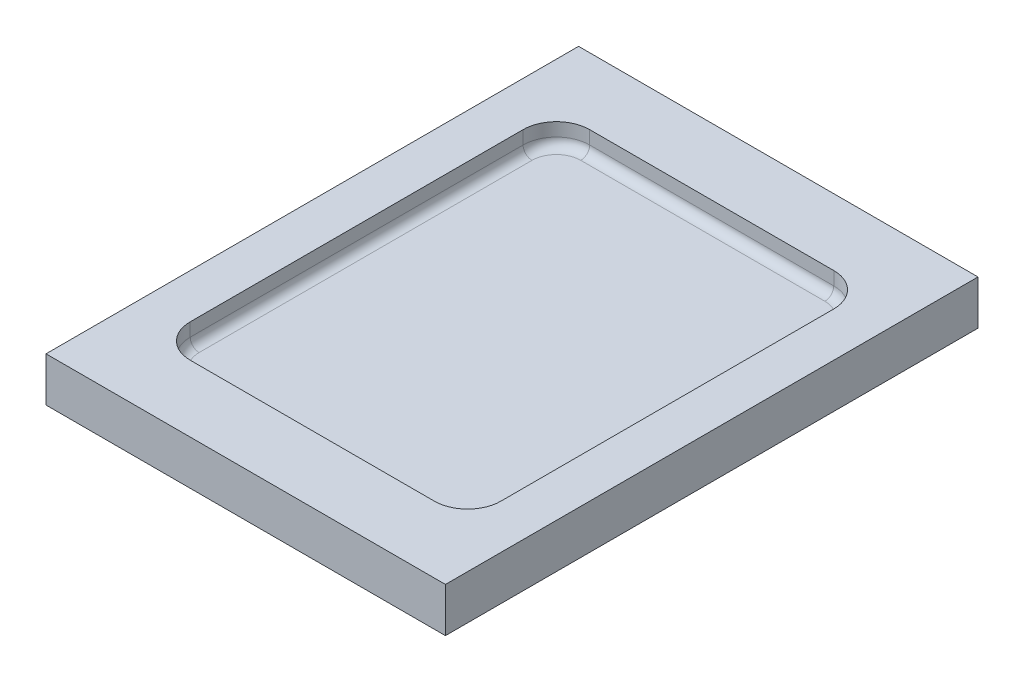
ISO-10303-21;
HEADER;
FILE_DESCRIPTION(('STEP AP214'),'2;1');
FILE_NAME('part.step','',(''),(''),'','','');
FILE_SCHEMA(('AUTOMOTIVE_DESIGN { 1 0 10303 214 1 1 1 1 }'));
ENDSEC;
DATA;
#1=APPLICATION_CONTEXT('core data for automotive mechanical design processes');
#2=APPLICATION_PROTOCOL_DEFINITION('international standard','automotive_design',2000,#1);
#3=PRODUCT_CONTEXT('',#1,'mechanical');
#4=PRODUCT('Part','Part','',(#3));
#5=PRODUCT_RELATED_PRODUCT_CATEGORY('part','',(#4));
#6=PRODUCT_DEFINITION_FORMATION('','',#4);
#7=PRODUCT_DEFINITION_CONTEXT('part definition',#1,'design');
#8=PRODUCT_DEFINITION('design','',#6,#7);
#9=PRODUCT_DEFINITION_SHAPE('','',#8);
#10=(LENGTH_UNIT() NAMED_UNIT(*) SI_UNIT(.MILLI.,.METRE.));
#11=(NAMED_UNIT(*) PLANE_ANGLE_UNIT() SI_UNIT($,.RADIAN.));
#12=(NAMED_UNIT(*) SI_UNIT($,.STERADIAN.) SOLID_ANGLE_UNIT());
#13=UNCERTAINTY_MEASURE_WITH_UNIT(LENGTH_MEASURE(1.E-05),#10,'distance_accuracy_value','');
#14=(GEOMETRIC_REPRESENTATION_CONTEXT(3) GLOBAL_UNCERTAINTY_ASSIGNED_CONTEXT((#13)) GLOBAL_UNIT_ASSIGNED_CONTEXT((#10,
#11,#12)) REPRESENTATION_CONTEXT('',''));
#15=CARTESIAN_POINT('',(0.,0.,0.));
#16=DIRECTION('',(0.,0.,1.));
#17=DIRECTION('',(1.,0.,0.));
#18=AXIS2_PLACEMENT_3D('',#15,#16,#17);
#19=CARTESIAN_POINT('',(44.45,6.35,57.15));
#20=DIRECTION('',(0.,-1.,0.));
#21=DIRECTION('',(0.,0.,-1.));
#22=AXIS2_PLACEMENT_3D('',#19,#20,#21);
#23=PLANE('',#22);
#24=CARTESIAN_POINT('',(34.925,6.35,-47.625));
#25=DIRECTION('',(0.,-1.,0.));
#26=DIRECTION('',(0.,0.,-1.));
#27=AXIS2_PLACEMENT_3D('',#24,#25,#26);
#28=CIRCLE('',#27,6.985);
#29=CARTESIAN_POINT('',(34.925,6.35,-54.61));
#30=VERTEX_POINT('',#29);
#31=CARTESIAN_POINT('',(41.91,6.35,-47.625));
#32=VERTEX_POINT('',#31);
#33=EDGE_CURVE('E230',#30,#32,#28,.T.);
#34=ORIENTED_EDGE('',*,*,#33,.F.);
#35=DIRECTION('',(-1.,0.,0.));
#36=VECTOR('',#35,1.);
#37=CARTESIAN_POINT('',(-44.45,6.35,-54.61));
#38=LINE('',#37,#36);
#39=CARTESIAN_POINT('',(-34.925,6.35,-54.61));
#40=VERTEX_POINT('',#39);
#41=EDGE_CURVE('E167',#30,#40,#38,.T.);
#42=ORIENTED_EDGE('',*,*,#41,.T.);
#43=CARTESIAN_POINT('',(-34.925,6.35,-47.625));
#44=DIRECTION('',(0.,-1.,0.));
#45=DIRECTION('',(0.,0.,-1.));
#46=AXIS2_PLACEMENT_3D('',#43,#44,#45);
#47=CIRCLE('',#46,6.985);
#48=CARTESIAN_POINT('',(-41.91,6.35,-47.625));
#49=VERTEX_POINT('',#48);
#50=EDGE_CURVE('E228',#49,#40,#47,.T.);
#51=ORIENTED_EDGE('',*,*,#50,.F.);
#52=DIRECTION('',(0.,0.,1.));
#53=VECTOR('',#52,1.);
#54=CARTESIAN_POINT('',(-41.91,6.35,57.15));
#55=LINE('',#54,#53);
#56=CARTESIAN_POINT('',(-41.91,6.35,47.625));
#57=VERTEX_POINT('',#56);
#58=EDGE_CURVE('E203',#49,#57,#55,.T.);
#59=ORIENTED_EDGE('',*,*,#58,.T.);
#60=CARTESIAN_POINT('',(-34.925,6.35,47.625));
#61=DIRECTION('',(0.,-1.,0.));
#62=DIRECTION('',(0.,0.,-1.));
#63=AXIS2_PLACEMENT_3D('',#60,#61,#62);
#64=CIRCLE('',#63,6.985);
#65=CARTESIAN_POINT('',(-34.925,6.35,54.61));
#66=VERTEX_POINT('',#65);
#67=EDGE_CURVE('E225',#66,#57,#64,.T.);
#68=ORIENTED_EDGE('',*,*,#67,.F.);
#69=DIRECTION('',(1.,0.,0.));
#70=VECTOR('',#69,1.);
#71=CARTESIAN_POINT('',(44.45,6.35,54.61));
#72=LINE('',#71,#70);
#73=CARTESIAN_POINT('',(34.925,6.35,54.61));
#74=VERTEX_POINT('',#73);
#75=EDGE_CURVE('E200',#66,#74,#72,.T.);
#76=ORIENTED_EDGE('',*,*,#75,.T.);
#77=CARTESIAN_POINT('',(34.925,6.35,47.625));
#78=DIRECTION('',(0.,-1.,0.));
#79=DIRECTION('',(0.,0.,-1.));
#80=AXIS2_PLACEMENT_3D('',#77,#78,#79);
#81=CIRCLE('',#80,6.985);
#82=CARTESIAN_POINT('',(41.91,6.35,47.625));
#83=VERTEX_POINT('',#82);
#84=EDGE_CURVE('E222',#83,#74,#81,.T.);
#85=ORIENTED_EDGE('',*,*,#84,.F.);
#86=DIRECTION('',(0.,0.,-1.));
#87=VECTOR('',#86,1.);
#88=CARTESIAN_POINT('',(41.91,6.35,-57.15));
#89=LINE('',#88,#87);
#90=EDGE_CURVE('E197',#83,#32,#89,.T.);
#91=ORIENTED_EDGE('',*,*,#90,.T.);
#92=EDGE_LOOP('',(#34,#42,#51,#59,#68,#76,#85,#91));
#93=FACE_BOUND('',#92,.T.);
#94=ADVANCED_FACE('F36',(#93),#23,.F.);
#95=CARTESIAN_POINT('',(-57.15,12.7,-76.2));
#96=DIRECTION('',(1.,0.,0.));
#97=DIRECTION('',(0.,0.,-1.));
#98=AXIS2_PLACEMENT_3D('',#95,#96,#97);
#99=PLANE('',#98);
#100=DIRECTION('',(0.,0.,1.));
#101=VECTOR('',#100,1.);
#102=CARTESIAN_POINT('',(-57.15,0.,-76.2));
#103=LINE('',#102,#101);
#104=CARTESIAN_POINT('',(-57.15,0.,-76.2));
#105=VERTEX_POINT('',#104);
#106=CARTESIAN_POINT('',(-57.15,0.,76.2));
#107=VERTEX_POINT('',#106);
#108=EDGE_CURVE('E154',#105,#107,#103,.T.);
#109=ORIENTED_EDGE('',*,*,#108,.T.);
#110=DIRECTION('',(0.,-1.,0.));
#111=VECTOR('',#110,1.);
#112=CARTESIAN_POINT('',(-57.15,12.7,76.2));
#113=LINE('',#112,#111);
#114=CARTESIAN_POINT('',(-57.15,12.7,76.2));
#115=VERTEX_POINT('',#114);
#116=EDGE_CURVE('E161',#115,#107,#113,.T.);
#117=ORIENTED_EDGE('',*,*,#116,.F.);
#118=DIRECTION('',(0.,0.,1.));
#119=VECTOR('',#118,1.);
#120=CARTESIAN_POINT('',(-57.15,12.7,-76.2));
#121=LINE('',#120,#119);
#122=CARTESIAN_POINT('',(-57.15,12.7,-76.2));
#123=VERTEX_POINT('',#122);
#124=EDGE_CURVE('E183',#123,#115,#121,.T.);
#125=ORIENTED_EDGE('',*,*,#124,.F.);
#126=DIRECTION('',(0.,-1.,0.));
#127=VECTOR('',#126,1.);
#128=CARTESIAN_POINT('',(-57.15,12.7,-76.2));
#129=LINE('',#128,#127);
#130=EDGE_CURVE('E172',#123,#105,#129,.T.);
#131=ORIENTED_EDGE('',*,*,#130,.T.);
#132=EDGE_LOOP('',(#109,#117,#125,#131));
#133=FACE_BOUND('',#132,.T.);
#134=ADVANCED_FACE('F38',(#133),#99,.F.);
#135=CARTESIAN_POINT('',(-57.15,12.7,76.2));
#136=DIRECTION('',(0.,0.,-1.));
#137=DIRECTION('',(-1.,0.,0.));
#138=AXIS2_PLACEMENT_3D('',#135,#136,#137);
#139=PLANE('',#138);
#140=DIRECTION('',(1.,0.,0.));
#141=VECTOR('',#140,1.);
#142=CARTESIAN_POINT('',(-57.15,0.,76.2));
#143=LINE('',#142,#141);
#144=CARTESIAN_POINT('',(57.15,0.,76.2));
#145=VERTEX_POINT('',#144);
#146=EDGE_CURVE('E149',#107,#145,#143,.T.);
#147=ORIENTED_EDGE('',*,*,#146,.T.);
#148=DIRECTION('',(0.,-1.,0.));
#149=VECTOR('',#148,1.);
#150=CARTESIAN_POINT('',(57.15,12.7,76.2));
#151=LINE('',#150,#149);
#152=CARTESIAN_POINT('',(57.15,12.7,76.2));
#153=VERTEX_POINT('',#152);
#154=EDGE_CURVE('E168',#153,#145,#151,.T.);
#155=ORIENTED_EDGE('',*,*,#154,.F.);
#156=DIRECTION('',(1.,0.,0.));
#157=VECTOR('',#156,1.);
#158=CARTESIAN_POINT('',(-57.15,12.7,76.2));
#159=LINE('',#158,#157);
#160=EDGE_CURVE('E163',#115,#153,#159,.T.);
#161=ORIENTED_EDGE('',*,*,#160,.F.);
#162=ORIENTED_EDGE('',*,*,#116,.T.);
#163=EDGE_LOOP('',(#147,#155,#161,#162));
#164=FACE_BOUND('',#163,.T.);
#165=ADVANCED_FACE('F162',(#164),#139,.F.);
#166=CARTESIAN_POINT('',(57.15,12.7,-76.2));
#167=DIRECTION('',(-1.,0.,0.));
#168=DIRECTION('',(0.,0.,1.));
#169=AXIS2_PLACEMENT_3D('',#166,#167,#168);
#170=PLANE('',#169);
#171=DIRECTION('',(0.,0.,-1.));
#172=VECTOR('',#171,1.);
#173=CARTESIAN_POINT('',(57.15,0.,-76.2));
#174=LINE('',#173,#172);
#175=CARTESIAN_POINT('',(57.15,0.,-76.2));
#176=VERTEX_POINT('',#175);
#177=EDGE_CURVE('E155',#145,#176,#174,.T.);
#178=ORIENTED_EDGE('',*,*,#177,.T.);
#179=DIRECTION('',(0.,-1.,0.));
#180=VECTOR('',#179,1.);
#181=CARTESIAN_POINT('',(57.15,12.7,-76.2));
#182=LINE('',#181,#180);
#183=CARTESIAN_POINT('',(57.15,12.7,-76.2));
#184=VERTEX_POINT('',#183);
#185=EDGE_CURVE('E191',#184,#176,#182,.T.);
#186=ORIENTED_EDGE('',*,*,#185,.F.);
#187=DIRECTION('',(0.,0.,-1.));
#188=VECTOR('',#187,1.);
#189=CARTESIAN_POINT('',(57.15,12.7,-76.2));
#190=LINE('',#189,#188);
#191=EDGE_CURVE('E186',#153,#184,#190,.T.);
#192=ORIENTED_EDGE('',*,*,#191,.F.);
#193=ORIENTED_EDGE('',*,*,#154,.T.);
#194=EDGE_LOOP('',(#178,#186,#192,#193));
#195=FACE_BOUND('',#194,.T.);
#196=ADVANCED_FACE('F480',(#195),#170,.F.);
#197=CARTESIAN_POINT('',(-57.15,12.7,-76.2));
#198=DIRECTION('',(0.,0.,1.));
#199=DIRECTION('',(1.,0.,0.));
#200=AXIS2_PLACEMENT_3D('',#197,#198,#199);
#201=PLANE('',#200);
#202=DIRECTION('',(-1.,0.,0.));
#203=VECTOR('',#202,1.);
#204=CARTESIAN_POINT('',(-57.15,0.,-76.2));
#205=LINE('',#204,#203);
#206=EDGE_CURVE('E181',#176,#105,#205,.T.);
#207=ORIENTED_EDGE('',*,*,#206,.T.);
#208=ORIENTED_EDGE('',*,*,#130,.F.);
#209=DIRECTION('',(-1.,0.,0.));
#210=VECTOR('',#209,1.);
#211=CARTESIAN_POINT('',(-57.15,12.7,-76.2));
#212=LINE('',#211,#210);
#213=EDGE_CURVE('E188',#184,#123,#212,.T.);
#214=ORIENTED_EDGE('',*,*,#213,.F.);
#215=ORIENTED_EDGE('',*,*,#185,.T.);
#216=EDGE_LOOP('',(#207,#208,#214,#215));
#217=FACE_BOUND('',#216,.T.);
#218=ADVANCED_FACE('F460',(#217),#201,.F.);
#219=CARTESIAN_POINT('',(-57.15,12.7,76.2));
#220=DIRECTION('',(0.,1.,0.));
#221=DIRECTION('',(0.,0.,1.));
#222=AXIS2_PLACEMENT_3D('',#219,#220,#221);
#223=PLANE('',#222);
#224=DIRECTION('',(0.,0.,-1.));
#225=VECTOR('',#224,1.);
#226=CARTESIAN_POINT('',(44.45,12.7,-57.15));
#227=LINE('',#226,#225);
#228=CARTESIAN_POINT('',(44.45,12.7,47.625));
#229=VERTEX_POINT('',#228);
#230=CARTESIAN_POINT('',(44.45,12.7,-47.625));
#231=VERTEX_POINT('',#230);
#232=EDGE_CURVE('E310',#229,#231,#227,.T.);
#233=ORIENTED_EDGE('',*,*,#232,.F.);
#234=CARTESIAN_POINT('',(34.925,12.7,47.625));
#235=DIRECTION('',(0.,1.,0.));
#236=DIRECTION('',(0.,0.,1.));
#237=AXIS2_PLACEMENT_3D('',#234,#235,#236);
#238=CIRCLE('',#237,9.525);
#239=CARTESIAN_POINT('',(34.925,12.7,57.15));
#240=VERTEX_POINT('',#239);
#241=EDGE_CURVE('E260',#229,#240,#238,.F.);
#242=ORIENTED_EDGE('',*,*,#241,.T.);
#243=DIRECTION('',(1.,0.,0.));
#244=VECTOR('',#243,1.);
#245=CARTESIAN_POINT('',(44.45,12.7,57.15));
#246=LINE('',#245,#244);
#247=CARTESIAN_POINT('',(-34.925,12.7,57.15));
#248=VERTEX_POINT('',#247);
#249=EDGE_CURVE('E173',#248,#240,#246,.T.);
#250=ORIENTED_EDGE('',*,*,#249,.F.);
#251=CARTESIAN_POINT('',(-34.925,12.7,47.625));
#252=DIRECTION('',(0.,1.,0.));
#253=DIRECTION('',(0.,0.,1.));
#254=AXIS2_PLACEMENT_3D('',#251,#252,#253);
#255=CIRCLE('',#254,9.525);
#256=CARTESIAN_POINT('',(-44.45,12.7,47.625));
#257=VERTEX_POINT('',#256);
#258=EDGE_CURVE('E262',#248,#257,#255,.F.);
#259=ORIENTED_EDGE('',*,*,#258,.T.);
#260=DIRECTION('',(0.,0.,1.));
#261=VECTOR('',#260,1.);
#262=CARTESIAN_POINT('',(-44.45,12.7,-57.15));
#263=LINE('',#262,#261);
#264=CARTESIAN_POINT('',(-44.45,12.7,-47.625));
#265=VERTEX_POINT('',#264);
#266=EDGE_CURVE('E176',#265,#257,#263,.T.);
#267=ORIENTED_EDGE('',*,*,#266,.F.);
#268=CARTESIAN_POINT('',(-34.925,12.7,-47.625));
#269=DIRECTION('',(0.,1.,0.));
#270=DIRECTION('',(0.,0.,1.));
#271=AXIS2_PLACEMENT_3D('',#268,#269,#270);
#272=CIRCLE('',#271,9.525);
#273=CARTESIAN_POINT('',(-34.925,12.7,-57.15));
#274=VERTEX_POINT('',#273);
#275=EDGE_CURVE('E44',#265,#274,#272,.F.);
#276=ORIENTED_EDGE('',*,*,#275,.T.);
#277=DIRECTION('',(-1.,0.,0.));
#278=VECTOR('',#277,1.);
#279=CARTESIAN_POINT('',(44.45,12.7,-57.15));
#280=LINE('',#279,#278);
#281=CARTESIAN_POINT('',(34.925,12.7,-57.15));
#282=VERTEX_POINT('',#281);
#283=EDGE_CURVE('E276',#282,#274,#280,.T.);
#284=ORIENTED_EDGE('',*,*,#283,.F.);
#285=CARTESIAN_POINT('',(34.925,12.7,-47.625));
#286=DIRECTION('',(0.,1.,0.));
#287=DIRECTION('',(0.,0.,1.));
#288=AXIS2_PLACEMENT_3D('',#285,#286,#287);
#289=CIRCLE('',#288,9.525);
#290=EDGE_CURVE('E11',#282,#231,#289,.F.);
#291=ORIENTED_EDGE('',*,*,#290,.T.);
#292=EDGE_LOOP('',(#233,#242,#250,#259,#267,#276,#284,#291));
#293=FACE_BOUND('',#292,.T.);
#294=ORIENTED_EDGE('',*,*,#124,.T.);
#295=ORIENTED_EDGE('',*,*,#160,.T.);
#296=ORIENTED_EDGE('',*,*,#191,.T.);
#297=ORIENTED_EDGE('',*,*,#213,.T.);
#298=EDGE_LOOP('',(#294,#295,#296,#297));
#299=FACE_BOUND('',#298,.T.);
#300=ADVANCED_FACE('F267',(#293,#299),#223,.T.);
#301=CARTESIAN_POINT('',(-57.15,0.,76.2));
#302=DIRECTION('',(0.,1.,0.));
#303=DIRECTION('',(0.,0.,1.));
#304=AXIS2_PLACEMENT_3D('',#301,#302,#303);
#305=PLANE('',#304);
#306=ORIENTED_EDGE('',*,*,#108,.F.);
#307=ORIENTED_EDGE('',*,*,#206,.F.);
#308=ORIENTED_EDGE('',*,*,#177,.F.);
#309=ORIENTED_EDGE('',*,*,#146,.F.);
#310=EDGE_LOOP('',(#306,#307,#308,#309));
#311=FACE_BOUND('',#310,.T.);
#312=ADVANCED_FACE('F151',(#311),#305,.F.);
#313=CARTESIAN_POINT('',(44.45,6.35,-57.15));
#314=DIRECTION('',(1.,0.,0.));
#315=DIRECTION('',(0.,0.,-1.));
#316=AXIS2_PLACEMENT_3D('',#313,#314,#315);
#317=PLANE('',#316);
#318=DIRECTION('',(0.,0.,-1.));
#319=VECTOR('',#318,1.);
#320=CARTESIAN_POINT('',(44.45,8.89,57.15));
#321=LINE('',#320,#319);
#322=CARTESIAN_POINT('',(44.45,8.89,-47.625));
#323=VERTEX_POINT('',#322);
#324=CARTESIAN_POINT('',(44.45,8.89,47.625));
#325=VERTEX_POINT('',#324);
#326=EDGE_CURVE('E212',#323,#325,#321,.F.);
#327=ORIENTED_EDGE('',*,*,#326,.T.);
#328=DIRECTION('',(0.,1.,0.));
#329=VECTOR('',#328,1.);
#330=CARTESIAN_POINT('',(44.45,12.7,47.625));
#331=LINE('',#330,#329);
#332=EDGE_CURVE('E247',#325,#229,#331,.T.);
#333=ORIENTED_EDGE('',*,*,#332,.T.);
#334=ORIENTED_EDGE('',*,*,#232,.T.);
#335=DIRECTION('',(0.,1.,0.));
#336=VECTOR('',#335,1.);
#337=CARTESIAN_POINT('',(44.45,8.89,-47.625));
#338=LINE('',#337,#336);
#339=EDGE_CURVE('E245',#231,#323,#338,.F.);
#340=ORIENTED_EDGE('',*,*,#339,.T.);
#341=EDGE_LOOP('',(#327,#333,#334,#340));
#342=FACE_BOUND('',#341,.T.);
#343=ADVANCED_FACE('F325',(#342),#317,.F.);
#344=CARTESIAN_POINT('',(44.45,6.35,57.15));
#345=DIRECTION('',(0.,0.,1.));
#346=DIRECTION('',(1.,0.,0.));
#347=AXIS2_PLACEMENT_3D('',#344,#345,#346);
#348=PLANE('',#347);
#349=ORIENTED_EDGE('',*,*,#249,.T.);
#350=DIRECTION('',(0.,1.,0.));
#351=VECTOR('',#350,1.);
#352=CARTESIAN_POINT('',(34.925,8.89,57.15));
#353=LINE('',#352,#351);
#354=CARTESIAN_POINT('',(34.925,8.89,57.15));
#355=VERTEX_POINT('',#354);
#356=EDGE_CURVE('E251',#240,#355,#353,.F.);
#357=ORIENTED_EDGE('',*,*,#356,.T.);
#358=DIRECTION('',(1.,0.,0.));
#359=VECTOR('',#358,1.);
#360=CARTESIAN_POINT('',(-44.45,8.89,57.15));
#361=LINE('',#360,#359);
#362=CARTESIAN_POINT('',(-34.925,8.89,57.15));
#363=VERTEX_POINT('',#362);
#364=EDGE_CURVE('E209',#355,#363,#361,.F.);
#365=ORIENTED_EDGE('',*,*,#364,.T.);
#366=DIRECTION('',(0.,1.,0.));
#367=VECTOR('',#366,1.);
#368=CARTESIAN_POINT('',(-34.925,12.7,57.15));
#369=LINE('',#368,#367);
#370=EDGE_CURVE('E249',#363,#248,#369,.T.);
#371=ORIENTED_EDGE('',*,*,#370,.T.);
#372=EDGE_LOOP('',(#349,#357,#365,#371));
#373=FACE_BOUND('',#372,.T.);
#374=ADVANCED_FACE('F344',(#373),#348,.F.);
#375=CARTESIAN_POINT('',(-44.45,6.35,-57.15));
#376=DIRECTION('',(-1.,0.,0.));
#377=DIRECTION('',(0.,0.,1.));
#378=AXIS2_PLACEMENT_3D('',#375,#376,#377);
#379=PLANE('',#378);
#380=ORIENTED_EDGE('',*,*,#266,.T.);
#381=DIRECTION('',(0.,1.,0.));
#382=VECTOR('',#381,1.);
#383=CARTESIAN_POINT('',(-44.45,8.89,47.625));
#384=LINE('',#383,#382);
#385=CARTESIAN_POINT('',(-44.45,8.89,47.625));
#386=VERTEX_POINT('',#385);
#387=EDGE_CURVE('E255',#257,#386,#384,.F.);
#388=ORIENTED_EDGE('',*,*,#387,.T.);
#389=DIRECTION('',(0.,0.,1.));
#390=VECTOR('',#389,1.);
#391=CARTESIAN_POINT('',(-44.45,8.89,-57.15));
#392=LINE('',#391,#390);
#393=CARTESIAN_POINT('',(-44.45,8.89,-47.625));
#394=VERTEX_POINT('',#393);
#395=EDGE_CURVE('E206',#386,#394,#392,.F.);
#396=ORIENTED_EDGE('',*,*,#395,.T.);
#397=DIRECTION('',(0.,1.,0.));
#398=VECTOR('',#397,1.);
#399=CARTESIAN_POINT('',(-44.45,12.7,-47.625));
#400=LINE('',#399,#398);
#401=EDGE_CURVE('E253',#394,#265,#400,.T.);
#402=ORIENTED_EDGE('',*,*,#401,.T.);
#403=EDGE_LOOP('',(#380,#388,#396,#402));
#404=FACE_BOUND('',#403,.T.);
#405=ADVANCED_FACE('F273',(#404),#379,.F.);
#406=CARTESIAN_POINT('',(44.45,6.35,-57.15));
#407=DIRECTION('',(0.,0.,-1.));
#408=DIRECTION('',(-1.,0.,0.));
#409=AXIS2_PLACEMENT_3D('',#406,#407,#408);
#410=PLANE('',#409);
#411=ORIENTED_EDGE('',*,*,#283,.T.);
#412=DIRECTION('',(0.,1.,0.));
#413=VECTOR('',#412,1.);
#414=CARTESIAN_POINT('',(-34.925,8.89,-57.15));
#415=LINE('',#414,#413);
#416=CARTESIAN_POINT('',(-34.925,8.89,-57.15));
#417=VERTEX_POINT('',#416);
#418=EDGE_CURVE('E258',#274,#417,#415,.F.);
#419=ORIENTED_EDGE('',*,*,#418,.T.);
#420=DIRECTION('',(-1.,0.,0.));
#421=VECTOR('',#420,1.);
#422=CARTESIAN_POINT('',(44.45,8.89,-57.15));
#423=LINE('',#422,#421);
#424=CARTESIAN_POINT('',(34.925,8.89,-57.15));
#425=VERTEX_POINT('',#424);
#426=EDGE_CURVE('E215',#417,#425,#423,.F.);
#427=ORIENTED_EDGE('',*,*,#426,.T.);
#428=DIRECTION('',(0.,1.,0.));
#429=VECTOR('',#428,1.);
#430=CARTESIAN_POINT('',(34.925,12.7,-57.15));
#431=LINE('',#430,#429);
#432=EDGE_CURVE('E57',#425,#282,#431,.T.);
#433=ORIENTED_EDGE('',*,*,#432,.T.);
#434=EDGE_LOOP('',(#411,#419,#427,#433));
#435=FACE_BOUND('',#434,.T.);
#436=ADVANCED_FACE('F316',(#435),#410,.F.);
#437=CARTESIAN_POINT('',(41.91,8.89,57.15));
#438=DIRECTION('',(0.,0.,1.));
#439=DIRECTION('',(1.,0.,0.));
#440=AXIS2_PLACEMENT_3D('',#437,#438,#439);
#441=CYLINDRICAL_SURFACE('',#440,2.54);
#442=ORIENTED_EDGE('',*,*,#326,.F.);
#443=CARTESIAN_POINT('',(41.91,8.89,-47.625));
#444=DIRECTION('',(0.,0.,-1.));
#445=DIRECTION('',(-1.,0.,0.));
#446=AXIS2_PLACEMENT_3D('',#443,#444,#445);
#447=CIRCLE('',#446,2.54);
#448=EDGE_CURVE('E219',#323,#32,#447,.T.);
#449=ORIENTED_EDGE('',*,*,#448,.T.);
#450=ORIENTED_EDGE('',*,*,#90,.F.);
#451=CARTESIAN_POINT('',(41.91,8.89,47.625));
#452=DIRECTION('',(0.,0.,1.));
#453=DIRECTION('',(1.,0.,0.));
#454=AXIS2_PLACEMENT_3D('',#451,#452,#453);
#455=CIRCLE('',#454,2.54);
#456=EDGE_CURVE('E217',#83,#325,#455,.T.);
#457=ORIENTED_EDGE('',*,*,#456,.T.);
#458=EDGE_LOOP('',(#442,#449,#450,#457));
#459=FACE_BOUND('',#458,.T.);
#460=ADVANCED_FACE('F328',(#459),#441,.F.);
#461=CARTESIAN_POINT('',(44.45,8.89,-54.61));
#462=DIRECTION('',(1.,0.,0.));
#463=DIRECTION('',(0.,0.,-1.));
#464=AXIS2_PLACEMENT_3D('',#461,#462,#463);
#465=CYLINDRICAL_SURFACE('',#464,2.54);
#466=ORIENTED_EDGE('',*,*,#426,.F.);
#467=CARTESIAN_POINT('',(-34.925,8.89,-54.61));
#468=DIRECTION('',(-1.,0.,0.));
#469=DIRECTION('',(0.,0.,1.));
#470=AXIS2_PLACEMENT_3D('',#467,#468,#469);
#471=CIRCLE('',#470,2.54);
#472=EDGE_CURVE('E234',#417,#40,#471,.T.);
#473=ORIENTED_EDGE('',*,*,#472,.T.);
#474=ORIENTED_EDGE('',*,*,#41,.F.);
#475=CARTESIAN_POINT('',(34.925,8.89,-54.61));
#476=DIRECTION('',(1.,0.,0.));
#477=DIRECTION('',(0.,0.,-1.));
#478=AXIS2_PLACEMENT_3D('',#475,#476,#477);
#479=CIRCLE('',#478,2.54);
#480=EDGE_CURVE('E232',#30,#425,#479,.T.);
#481=ORIENTED_EDGE('',*,*,#480,.T.);
#482=EDGE_LOOP('',(#466,#473,#474,#481));
#483=FACE_BOUND('',#482,.T.);
#484=ADVANCED_FACE('F301',(#483),#465,.F.);
#485=CARTESIAN_POINT('',(44.45,8.89,54.61));
#486=DIRECTION('',(-1.,0.,0.));
#487=DIRECTION('',(0.,0.,1.));
#488=AXIS2_PLACEMENT_3D('',#485,#486,#487);
#489=CYLINDRICAL_SURFACE('',#488,2.54);
#490=ORIENTED_EDGE('',*,*,#364,.F.);
#491=CARTESIAN_POINT('',(34.925,8.89,54.61));
#492=DIRECTION('',(1.,0.,0.));
#493=DIRECTION('',(0.,0.,-1.));
#494=AXIS2_PLACEMENT_3D('',#491,#492,#493);
#495=CIRCLE('',#494,2.54);
#496=EDGE_CURVE('E243',#355,#74,#495,.T.);
#497=ORIENTED_EDGE('',*,*,#496,.T.);
#498=ORIENTED_EDGE('',*,*,#75,.F.);
#499=CARTESIAN_POINT('',(-34.925,8.89,54.61));
#500=DIRECTION('',(-1.,0.,0.));
#501=DIRECTION('',(0.,0.,1.));
#502=AXIS2_PLACEMENT_3D('',#499,#500,#501);
#503=CIRCLE('',#502,2.54);
#504=EDGE_CURVE('E241',#66,#363,#503,.T.);
#505=ORIENTED_EDGE('',*,*,#504,.T.);
#506=EDGE_LOOP('',(#490,#497,#498,#505));
#507=FACE_BOUND('',#506,.T.);
#508=ADVANCED_FACE('F338',(#507),#489,.F.);
#509=CARTESIAN_POINT('',(-41.91,8.89,57.15));
#510=DIRECTION('',(0.,0.,-1.));
#511=DIRECTION('',(-1.,0.,0.));
#512=AXIS2_PLACEMENT_3D('',#509,#510,#511);
#513=CYLINDRICAL_SURFACE('',#512,2.54);
#514=ORIENTED_EDGE('',*,*,#395,.F.);
#515=CARTESIAN_POINT('',(-41.91,8.89,47.625));
#516=DIRECTION('',(0.,0.,1.));
#517=DIRECTION('',(1.,0.,0.));
#518=AXIS2_PLACEMENT_3D('',#515,#516,#517);
#519=CIRCLE('',#518,2.54);
#520=EDGE_CURVE('E239',#386,#57,#519,.T.);
#521=ORIENTED_EDGE('',*,*,#520,.T.);
#522=ORIENTED_EDGE('',*,*,#58,.F.);
#523=CARTESIAN_POINT('',(-41.91,8.89,-47.625));
#524=DIRECTION('',(0.,0.,-1.));
#525=DIRECTION('',(-1.,0.,0.));
#526=AXIS2_PLACEMENT_3D('',#523,#524,#525);
#527=CIRCLE('',#526,2.54);
#528=EDGE_CURVE('E237',#49,#394,#527,.T.);
#529=ORIENTED_EDGE('',*,*,#528,.T.);
#530=EDGE_LOOP('',(#514,#521,#522,#529));
#531=FACE_BOUND('',#530,.T.);
#532=ADVANCED_FACE('F290',(#531),#513,.F.);
#533=CARTESIAN_POINT('',(34.925,6.35,-47.625));
#534=DIRECTION('',(0.,-1.,0.));
#535=DIRECTION('',(0.,0.,-1.));
#536=AXIS2_PLACEMENT_3D('',#533,#534,#535);
#537=CYLINDRICAL_SURFACE('',#536,9.525);
#538=ORIENTED_EDGE('',*,*,#290,.F.);
#539=ORIENTED_EDGE('',*,*,#432,.F.);
#540=CARTESIAN_POINT('',(34.925,8.89,-47.625));
#541=DIRECTION('',(0.,-1.,0.));
#542=DIRECTION('',(0.,0.,-1.));
#543=AXIS2_PLACEMENT_3D('',#540,#541,#542);
#544=CIRCLE('',#543,9.525);
#545=EDGE_CURVE('E307',#323,#425,#544,.F.);
#546=ORIENTED_EDGE('',*,*,#545,.F.);
#547=ORIENTED_EDGE('',*,*,#339,.F.);
#548=EDGE_LOOP('',(#538,#539,#546,#547));
#549=FACE_BOUND('',#548,.T.);
#550=ADVANCED_FACE('F320',(#549),#537,.F.);
#551=CARTESIAN_POINT('',(34.925,8.89,-47.625));
#552=DIRECTION('',(0.,-1.,0.));
#553=DIRECTION('',(0.,0.,-1.));
#554=AXIS2_PLACEMENT_3D('',#551,#552,#553);
#555=TOROIDAL_SURFACE('',#554,6.985,2.54);
#556=ORIENTED_EDGE('',*,*,#448,.F.);
#557=ORIENTED_EDGE('',*,*,#545,.T.);
#558=ORIENTED_EDGE('',*,*,#480,.F.);
#559=ORIENTED_EDGE('',*,*,#33,.T.);
#560=EDGE_LOOP('',(#556,#557,#558,#559));
#561=FACE_BOUND('',#560,.T.);
#562=ADVANCED_FACE('F369',(#561),#555,.F.);
#563=CARTESIAN_POINT('',(-34.925,6.35,-47.625));
#564=DIRECTION('',(0.,-1.,0.));
#565=DIRECTION('',(0.,0.,-1.));
#566=AXIS2_PLACEMENT_3D('',#563,#564,#565);
#567=CYLINDRICAL_SURFACE('',#566,9.525);
#568=ORIENTED_EDGE('',*,*,#275,.F.);
#569=ORIENTED_EDGE('',*,*,#401,.F.);
#570=CARTESIAN_POINT('',(-34.925,8.89,-47.625));
#571=DIRECTION('',(0.,-1.,0.));
#572=DIRECTION('',(0.,0.,-1.));
#573=AXIS2_PLACEMENT_3D('',#570,#571,#572);
#574=CIRCLE('',#573,9.525);
#575=EDGE_CURVE('E283',#417,#394,#574,.F.);
#576=ORIENTED_EDGE('',*,*,#575,.F.);
#577=ORIENTED_EDGE('',*,*,#418,.F.);
#578=EDGE_LOOP('',(#568,#569,#576,#577));
#579=FACE_BOUND('',#578,.T.);
#580=ADVANCED_FACE('F306',(#579),#567,.F.);
#581=CARTESIAN_POINT('',(-34.925,8.89,-47.625));
#582=DIRECTION('',(0.,-1.,0.));
#583=DIRECTION('',(0.,0.,-1.));
#584=AXIS2_PLACEMENT_3D('',#581,#582,#583);
#585=TOROIDAL_SURFACE('',#584,6.985,2.54);
#586=ORIENTED_EDGE('',*,*,#472,.F.);
#587=ORIENTED_EDGE('',*,*,#575,.T.);
#588=ORIENTED_EDGE('',*,*,#528,.F.);
#589=ORIENTED_EDGE('',*,*,#50,.T.);
#590=EDGE_LOOP('',(#586,#587,#588,#589));
#591=FACE_BOUND('',#590,.T.);
#592=ADVANCED_FACE('F297',(#591),#585,.F.);
#593=CARTESIAN_POINT('',(-34.925,6.35,47.625));
#594=DIRECTION('',(0.,-1.,0.));
#595=DIRECTION('',(0.,0.,-1.));
#596=AXIS2_PLACEMENT_3D('',#593,#594,#595);
#597=CYLINDRICAL_SURFACE('',#596,9.525);
#598=ORIENTED_EDGE('',*,*,#258,.F.);
#599=ORIENTED_EDGE('',*,*,#370,.F.);
#600=CARTESIAN_POINT('',(-34.925,8.89,47.625));
#601=DIRECTION('',(0.,-1.,0.));
#602=DIRECTION('',(0.,0.,-1.));
#603=AXIS2_PLACEMENT_3D('',#600,#601,#602);
#604=CIRCLE('',#603,9.525);
#605=EDGE_CURVE('E280',#386,#363,#604,.F.);
#606=ORIENTED_EDGE('',*,*,#605,.F.);
#607=ORIENTED_EDGE('',*,*,#387,.F.);
#608=EDGE_LOOP('',(#598,#599,#606,#607));
#609=FACE_BOUND('',#608,.T.);
#610=ADVANCED_FACE('F278',(#609),#597,.F.);
#611=CARTESIAN_POINT('',(-34.925,8.89,47.625));
#612=DIRECTION('',(0.,-1.,0.));
#613=DIRECTION('',(0.,0.,-1.));
#614=AXIS2_PLACEMENT_3D('',#611,#612,#613);
#615=TOROIDAL_SURFACE('',#614,6.985,2.54);
#616=ORIENTED_EDGE('',*,*,#504,.F.);
#617=ORIENTED_EDGE('',*,*,#67,.T.);
#618=ORIENTED_EDGE('',*,*,#520,.F.);
#619=ORIENTED_EDGE('',*,*,#605,.T.);
#620=EDGE_LOOP('',(#616,#617,#618,#619));
#621=FACE_BOUND('',#620,.T.);
#622=ADVANCED_FACE('F286',(#621),#615,.F.);
#623=CARTESIAN_POINT('',(34.925,6.35,47.625));
#624=DIRECTION('',(0.,-1.,0.));
#625=DIRECTION('',(0.,0.,-1.));
#626=AXIS2_PLACEMENT_3D('',#623,#624,#625);
#627=CYLINDRICAL_SURFACE('',#626,9.525);
#628=ORIENTED_EDGE('',*,*,#241,.F.);
#629=ORIENTED_EDGE('',*,*,#332,.F.);
#630=CARTESIAN_POINT('',(34.925,8.89,47.625));
#631=DIRECTION('',(0.,-1.,0.));
#632=DIRECTION('',(0.,0.,-1.));
#633=AXIS2_PLACEMENT_3D('',#630,#631,#632);
#634=CIRCLE('',#633,9.525);
#635=EDGE_CURVE('E284',#355,#325,#634,.F.);
#636=ORIENTED_EDGE('',*,*,#635,.F.);
#637=ORIENTED_EDGE('',*,*,#356,.F.);
#638=EDGE_LOOP('',(#628,#629,#636,#637));
#639=FACE_BOUND('',#638,.T.);
#640=ADVANCED_FACE('F343',(#639),#627,.F.);
#641=CARTESIAN_POINT('',(34.925,8.89,47.625));
#642=DIRECTION('',(0.,-1.,0.));
#643=DIRECTION('',(0.,0.,-1.));
#644=AXIS2_PLACEMENT_3D('',#641,#642,#643);
#645=TOROIDAL_SURFACE('',#644,6.985,2.54);
#646=ORIENTED_EDGE('',*,*,#456,.F.);
#647=ORIENTED_EDGE('',*,*,#84,.T.);
#648=ORIENTED_EDGE('',*,*,#496,.F.);
#649=ORIENTED_EDGE('',*,*,#635,.T.);
#650=EDGE_LOOP('',(#646,#647,#648,#649));
#651=FACE_BOUND('',#650,.T.);
#652=ADVANCED_FACE('F333',(#651),#645,.F.);
#653=CLOSED_SHELL('',(#94,#134,#165,#196,#218,#300,#312,#343,#374,#405,#436,#460,#484,#508,#532,
#550,#562,#580,#592,#610,#622,#640,#652));
#654=MANIFOLD_SOLID_BREP('B2',#653);
#655=ADVANCED_BREP_SHAPE_REPRESENTATION('',(#18,#654),#14);
#656=SHAPE_DEFINITION_REPRESENTATION(#9,#655);
ENDSEC;
END-ISO-10303-21;
